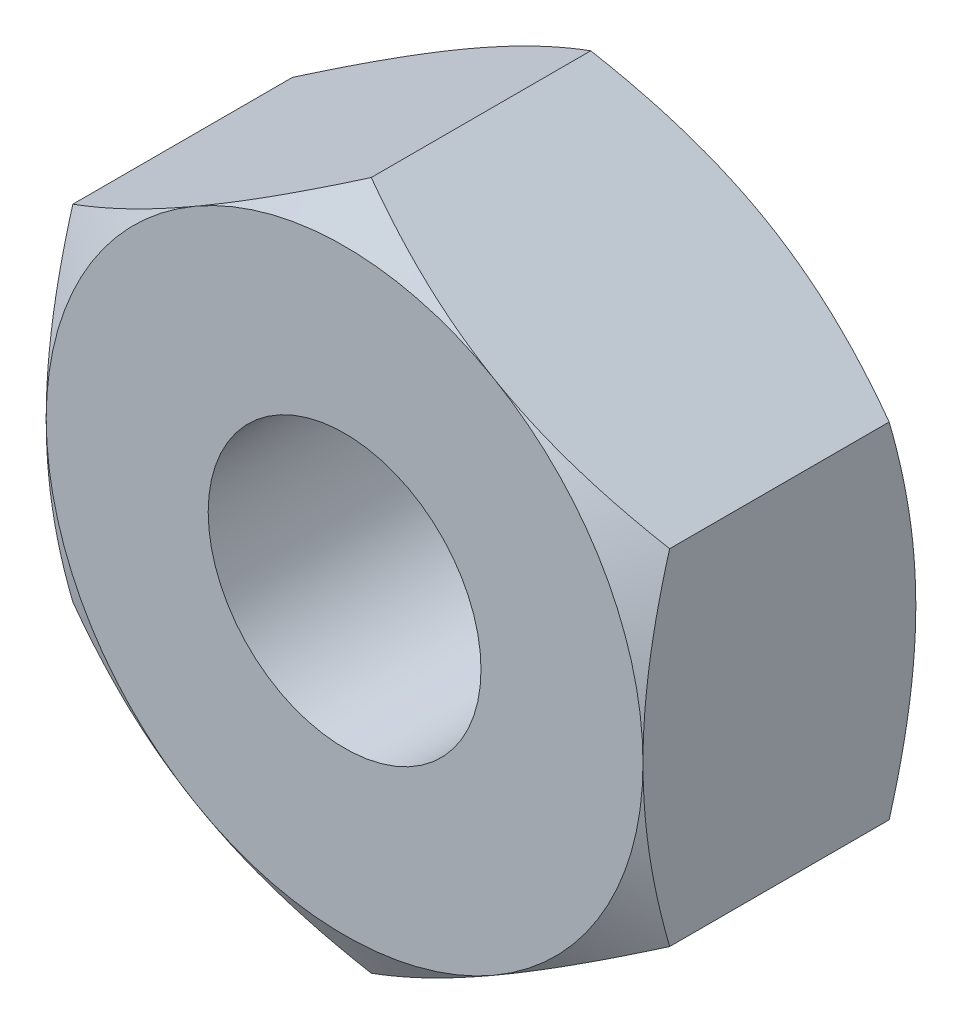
from build123d import *

# Parameters (mm, degrees)
BASE_EXTRUSION_DEPTH    = 3.2
ESQUISSE3_R             = 1.6
ENL_V_MAT_EXTRU_1_DEPTH = 7.23083729


with BuildPart() as part:
    # Esquisse1 → Base-Extrusion (new body)
    with BuildSketch(Plane.XY):
        Polygon((3.5, -2.020725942), (3.5, 2.020725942), (0, 4.041451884), (-3.5, 2.020725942), (-3.5, -2.020725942), (0, -4.041451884), align=None)
    extrude(amount=-BASE_EXTRUSION_DEPTH)

    # Esquisse2 → Enl_vement de mati_re-R_volution1 (revolve, cut)
    with BuildSketch(Plane(origin=(0, 0, 0), x_dir=(1, 0, 0), z_dir=(0, 1, 0)), mode=Mode.PRIVATE) as enl_vement_de_mati_re_r_volution1_sk:
        Polygon((-3.5, 0), (-7.271281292, 0), (-7.271281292, 3.2), (-3.5, 3.2), (-6.271281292, 1.6), align=None)
    revolve(enl_vement_de_mati_re_r_volution1_sk.sketch.rotate(Axis((0, 0, -3.2), (0, 0, 1)), 180), axis=Axis((0, 0, -3.2), (0, 0, 1)), mode=Mode.SUBTRACT)

    # Esquisse3 → Enl_v. mat.-Extru.1 (cut, through all)
    with BuildSketch(Plane.XY):
        Circle(ESQUISSE3_R)
    extrude(amount=-ENL_V_MAT_EXTRU_1_DEPTH, mode=Mode.SUBTRACT)


solid = part.part
